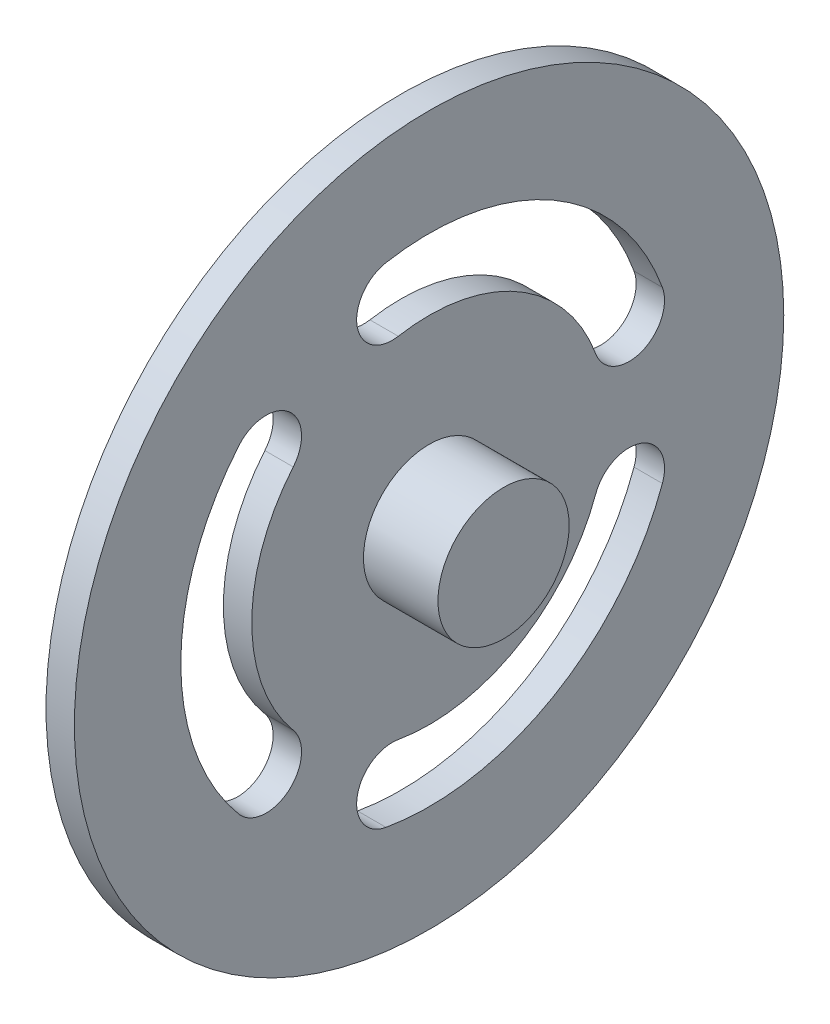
from build123d import *

# Parameters (mm, degrees)
CUT_EXTRUDE1_DEPTH = 145.364122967
CIRPATTERN1_COUNT  = 3


with BuildPart() as part:
    # Sketch1 → Revolve1 (revolve)
    with BuildSketch(Plane.XY, mode=Mode.PRIVATE) as revolve1_sk:
        Polygon((25, 0), (25, 18.5), (4, 18.5), (4, 100), (-4, 100), (-4, 18.5), (-25, 18.5), (-25, 0), align=None)
    revolve(revolve1_sk.sketch.rotate(Axis((25, 0, 0), (-1, 0, 0)), 90), axis=Axis((25, 0, 0), (-1, 0, 0)))

    # Sketch2 → Cut-Extrude1 (cut, through all)
    with BuildSketch(Plane(origin=(4, 0, 0), x_dir=(0, 0, -1), z_dir=(1, 0, 0))):
        with BuildLine():
            ThreePointArc((65.778483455, 23.941410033), (35, 60.621778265), (-12.155372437, 68.936542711))
            ThreePointArc((-12.155372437, 68.936542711), (-20.26696819, 57.351983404), (-8.682408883, 49.240387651))
            ThreePointArc((-8.682408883, 49.240387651), (25, 43.301270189), (46.984631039, 17.101007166))
            ThreePointArc((46.984631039, 17.101007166), (59.80175868, 11.124282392), (65.778483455, 23.941410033))
        make_face()
    cut_extrude1 = extrude(amount=-CUT_EXTRUDE1_DEPTH, mode=Mode.SUBTRACT)

    # CirPattern1: Cut-Extrude1 ×3 about axis
    cirpattern1_axis = Axis((0, 0, 0), (1, 0, 0))
    for i in range(1, CIRPATTERN1_COUNT):
        add(cut_extrude1.rotate(cirpattern1_axis, i * 360 / CIRPATTERN1_COUNT), mode=Mode.SUBTRACT)


solid = part.part
